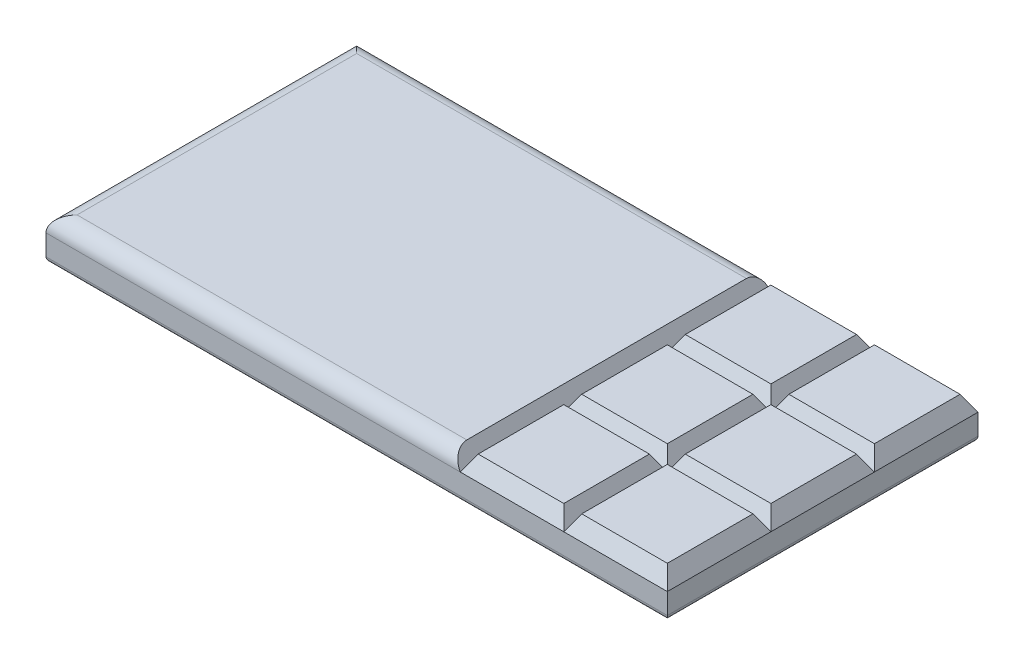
from build123d import *

# Parameters (mm, degrees)
SKETCH1_W           = 120
SKETCH1_H           = 60
BOSS_EXTRUDE1_DEPTH = 8
CUT_EXTRUDE1_DEPTH  = 86.229103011
CUT_EXTRUDE2_REACH  = 125.952
FILLET1_R           = 1
FILLET2_R           = 3


with BuildPart() as part:
    # Sketch1 → Boss-Extrude1 (new body)
    with BuildSketch(Plane(origin=(0, 0, 0), x_dir=(1, 0, 0), z_dir=(0, 1, 0))):
        Rectangle(SKETCH1_W, SKETCH1_H)
    extrude(amount=BOSS_EXTRUDE1_DEPTH)

    # Sketch2 → Cut-Extrude1 (cut, through all)
    with BuildSketch(Plane.XY.offset(30)):
        Polygon((40, 5), (42.598076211, 9.5), (37.401923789, 9.5), align=None)
        Polygon((20, 5), (22.598076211, 9.5), (17.401923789, 9.5), align=None)
        Polygon((60, 5), (62.598076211, 9.5), (57.401923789, 9.5), align=None)
    extrude(amount=-CUT_EXTRUDE1_DEPTH, mode=Mode.SUBTRACT)

    # Cut-Extrude2: up to this face of the body (flat: up to its plane)
    cut_extrude2_end = Plane(part.part.faces().sort_by_distance((19.133974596, 6.5, 0))[0])
    # Sketch3 → Cut-Extrude2 (cut, up to the picked face)
    with BuildSketch(Plane(origin=(60, 0, 0), x_dir=(0, 0, -1), z_dir=(1, 0, 0)), mode=Mode.PRIVATE) as cut_extrude2_sk1:
        Polygon((-10, 5), (-7.401923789, 9.5), (-12.598076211, 9.5), align=None)
    cut_extrude2_tool1 = split(extrude(cut_extrude2_sk1.sketch, amount=-CUT_EXTRUDE2_REACH, mode=Mode.PRIVATE), bisect_by=cut_extrude2_end, keep=Keep.BOTH, mode=Mode.PRIVATE)
    # Sketch3 → Cut-Extrude2 (cut, up to the picked face)
    with BuildSketch(Plane(origin=(60, 0, 0), x_dir=(0, 0, -1), z_dir=(1, 0, 0)), mode=Mode.PRIVATE) as cut_extrude2_sk2:
        Polygon((10, 5), (12.598076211, 9.5), (7.401923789, 9.5), align=None)
    cut_extrude2_tool2 = split(extrude(cut_extrude2_sk2.sketch, amount=-CUT_EXTRUDE2_REACH, mode=Mode.PRIVATE), bisect_by=cut_extrude2_end, keep=Keep.BOTH, mode=Mode.PRIVATE)
    # Sketch3 → Cut-Extrude2 (cut, up to the picked face)
    with BuildSketch(Plane(origin=(60, 0, 0), x_dir=(0, 0, -1), z_dir=(1, 0, 0)), mode=Mode.PRIVATE) as cut_extrude2_sk3:
        Polygon((30, 5), (32.598076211, 9.5), (27.401923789, 9.5), align=None)
    cut_extrude2_tool3 = split(extrude(cut_extrude2_sk3.sketch, amount=-CUT_EXTRUDE2_REACH, mode=Mode.PRIVATE), bisect_by=cut_extrude2_end, keep=Keep.BOTH, mode=Mode.PRIVATE)
    # Sketch3 → Cut-Extrude2 (cut, up to the picked face)
    with BuildSketch(Plane(origin=(60, 0, 0), x_dir=(0, 0, -1), z_dir=(1, 0, 0)), mode=Mode.PRIVATE) as cut_extrude2_sk4:
        Polygon((-30, 5), (-27.401923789, 9.5), (-32.598076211, 9.5), align=None)
    cut_extrude2_tool4 = split(extrude(cut_extrude2_sk4.sketch, amount=-CUT_EXTRUDE2_REACH, mode=Mode.PRIVATE), bisect_by=cut_extrude2_end, keep=Keep.BOTH, mode=Mode.PRIVATE)
    add(cut_extrude2_tool1.solids().sort_by(Axis((60, 8, 10), (-1, 0, 0)))[0], mode=Mode.SUBTRACT)
    add(cut_extrude2_tool2.solids().sort_by(Axis((60, 8, -10), (-1, 0, 0)))[0], mode=Mode.SUBTRACT)
    add(cut_extrude2_tool3.solids().sort_by(Axis((60, 8, -30), (-1, 0, 0)))[0], mode=Mode.SUBTRACT)
    add(cut_extrude2_tool4.solids().sort_by(Axis((60, 8, 30), (-1, 0, 0)))[0], mode=Mode.SUBTRACT)

    # Fillet1
    fillet1_edges = [part.edges().sort_by_distance(p)[0] for p in [
        (0, 0, 30),
        (-60, 0, 0),
        (0, 0, -30),
        (60, 0, 0),
    ]]
    fillet(fillet1_edges, radius=FILLET1_R)

    # Fillet2
    fillet2_edges = [part.edges().sort_by_distance(p)[0] for p in [
        (-20.866025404, 8, -30),
        (-60, 8, 0),
        (-20.866025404, 8, 30),
    ]]
    fillet(fillet2_edges, radius=FILLET2_R)


solid = part.part
